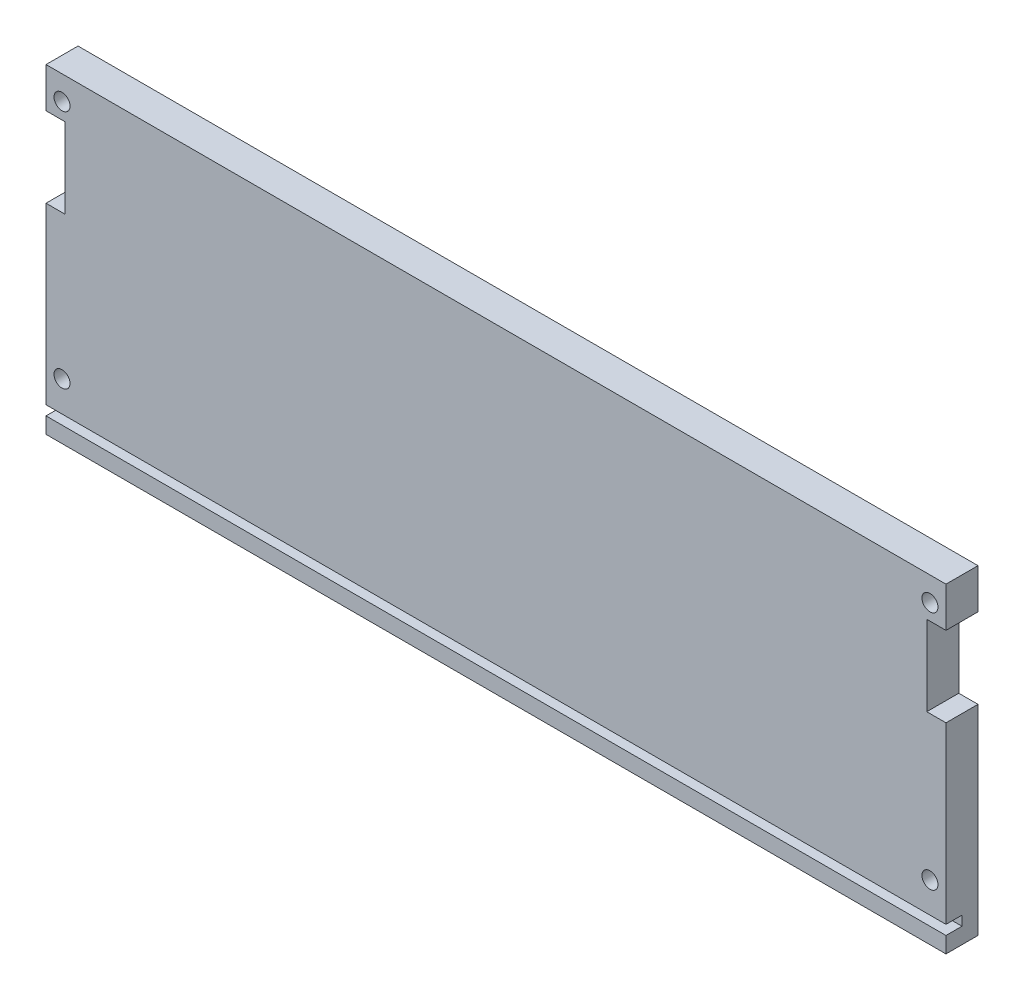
from build123d import *

# Parameters (mm, degrees)
SKETCH1_W           = 281
SKETCH1_H           = 100
BOSS_EXTRUDE1_DEPTH = 10
SKETCH2_R           = 2.5
CUT_EXTRUDE1_DEPTH  = 5
SKETCH4_W           = 6
SKETCH4_H           = 25
CUT_EXTRUDE2_DEPTH  = 150.466551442
SKETCH5_W           = 281
SKETCH5_H           = 3
CUT_EXTRUDE3_DEPTH  = 5


with BuildPart() as part:
    # Sketch1 → Boss-Extrude1 (new body)
    with BuildSketch(Plane.XY):
        Rectangle(SKETCH1_W, SKETCH1_H)
    extrude(amount=BOSS_EXTRUDE1_DEPTH)

    # Sketch2 → Cut-Extrude1 (cut)
    with BuildSketch(Plane.XY.offset(10)):
        with Locations((-135.5, -32.5)):
            Circle(SKETCH2_R)
        with Locations(Location((135.5, -32.5, 0), (0, 0, 180))):
            Circle(SKETCH2_R)
        with Locations((135.5, 42.5)):
            Circle(SKETCH2_R)
        with Locations(Location((-135.5, 42.5, 0), (0, 0, 180))):
            Circle(SKETCH2_R)
    extrude(amount=-CUT_EXTRUDE1_DEPTH, mode=Mode.SUBTRACT)

    # Sketch4 → Cut-Extrude2 (cut, through all)
    with BuildSketch(Plane(origin=(0, 0, 0), x_dir=(-1, 0, 0), z_dir=(0, 0, -1))):
        with Locations((-137.5, 25)):
            Rectangle(SKETCH4_W, SKETCH4_H)
        with Locations((137.5, 25)):
            Rectangle(SKETCH4_W, SKETCH4_H)
    extrude(amount=-CUT_EXTRUDE2_DEPTH, mode=Mode.SUBTRACT)

    # Sketch5 → Cut-Extrude3 (cut)
    with BuildSketch(Plane.XY.offset(10)):
        with Locations((0, -43.5)):
            Rectangle(SKETCH5_W, SKETCH5_H)
    extrude(amount=-CUT_EXTRUDE3_DEPTH, mode=Mode.SUBTRACT)


solid = part.part
